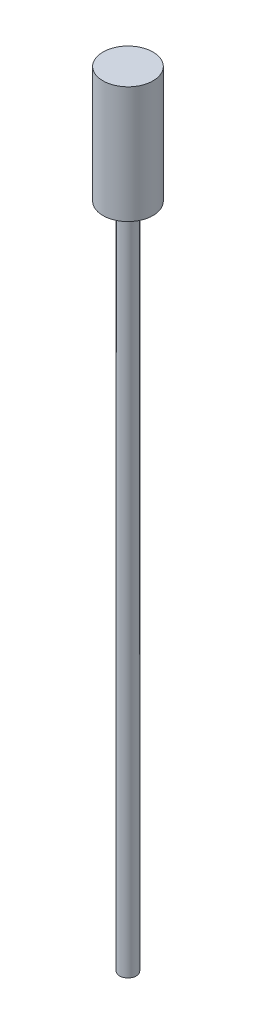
from build123d import *

# Parameters (mm, degrees)
SKETCH1_R           = 3
BOSS_EXTRUDE1_DEPTH = 14
SKETCH3_R           = 1
BOSS_EXTRUDE2_DEPTH = 80


with BuildPart() as part:
    # Sketch1 → Boss-Extrude1 (new body)
    with BuildSketch(Plane(origin=(0, 0, 0), x_dir=(1, 0, 0), z_dir=(0, 1, 0))):
        with Locations(Location((0, 0, 0), (0, 0, 270))):
            Circle(SKETCH1_R)
    extrude(amount=BOSS_EXTRUDE1_DEPTH)

    # Sketch3 → Boss-Extrude2 (add)
    with BuildSketch(Plane.XZ):
        with Locations(Location((0, 0, 0), (0, 0, 270))):
            Circle(SKETCH3_R)
    extrude(amount=BOSS_EXTRUDE2_DEPTH)


solid = part.part
